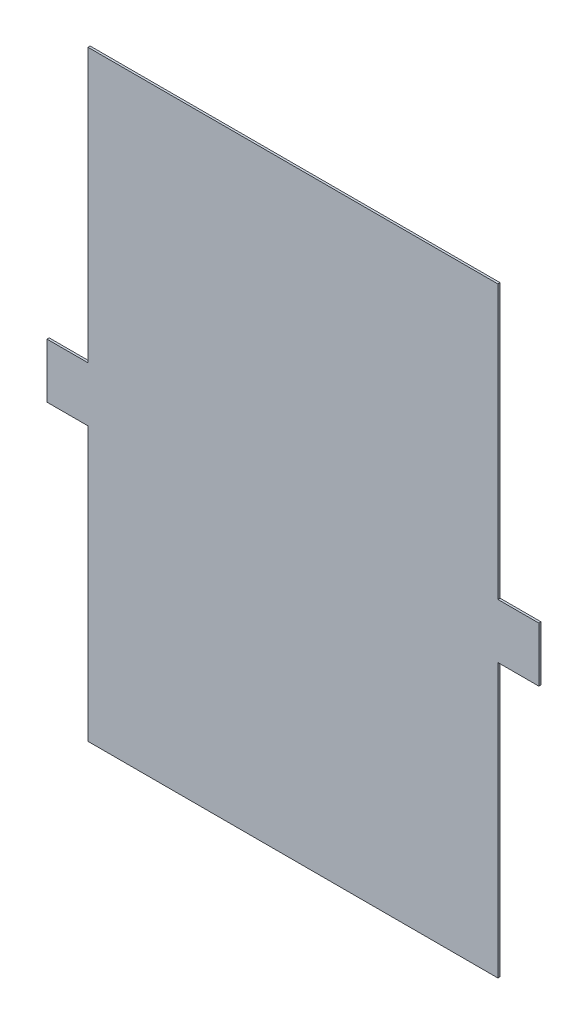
from build123d import *

# Parameters (mm, degrees)
BOSS_EXTRUDE1_DEPTH = 2.032


with BuildPart() as part:
    # Sketch1 → Boss-Extrude1 (new body)
    with BuildSketch(Plane.XY):
        Polygon((129.431914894, 13.960992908), (167.531914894, 13.960992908), (167.531914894, -36.839007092), (129.431914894, -36.839007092), (129.431914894, -290.839007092), (-251.568085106, -290.839007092), (-251.568085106, -36.839007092), (-289.668085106, -36.839007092), (-289.668085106, 13.960992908), (-251.568085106, 13.960992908), (-251.568085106, 267.960992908), (129.431914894, 267.960992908), align=None)
    extrude(amount=BOSS_EXTRUDE1_DEPTH)


solid = part.part
